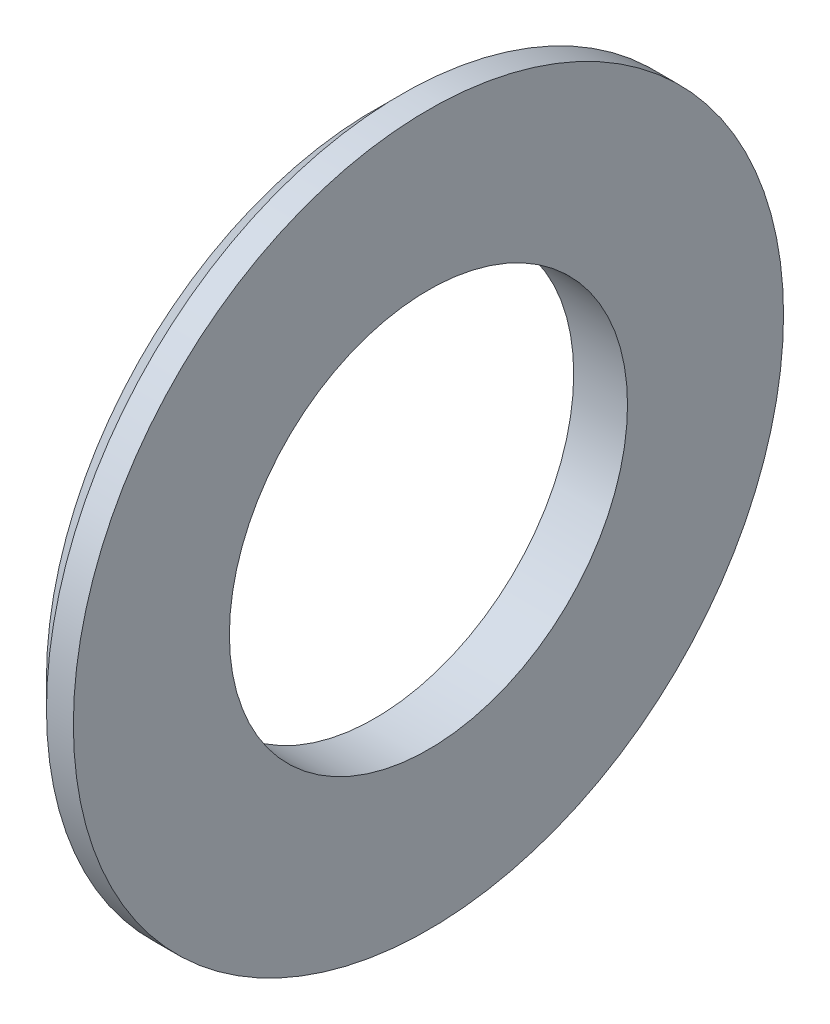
from build123d import *


with BuildPart() as part:
    # Sketch1 → Base-Revolve (revolve)
    with BuildSketch(Plane.XY, mode=Mode.PRIVATE) as base_revolve_sk:
        Polygon((0, 18.5), (0, 33), (-2.5, 33), (-5, 30.5), (-5, 18.5), align=None)
    revolve(base_revolve_sk.sketch.rotate(Axis((-34.925, 0, 0), (1, 0, 0)), 90), axis=Axis((-34.925, 0, 0), (1, 0, 0)))


solid = part.part
